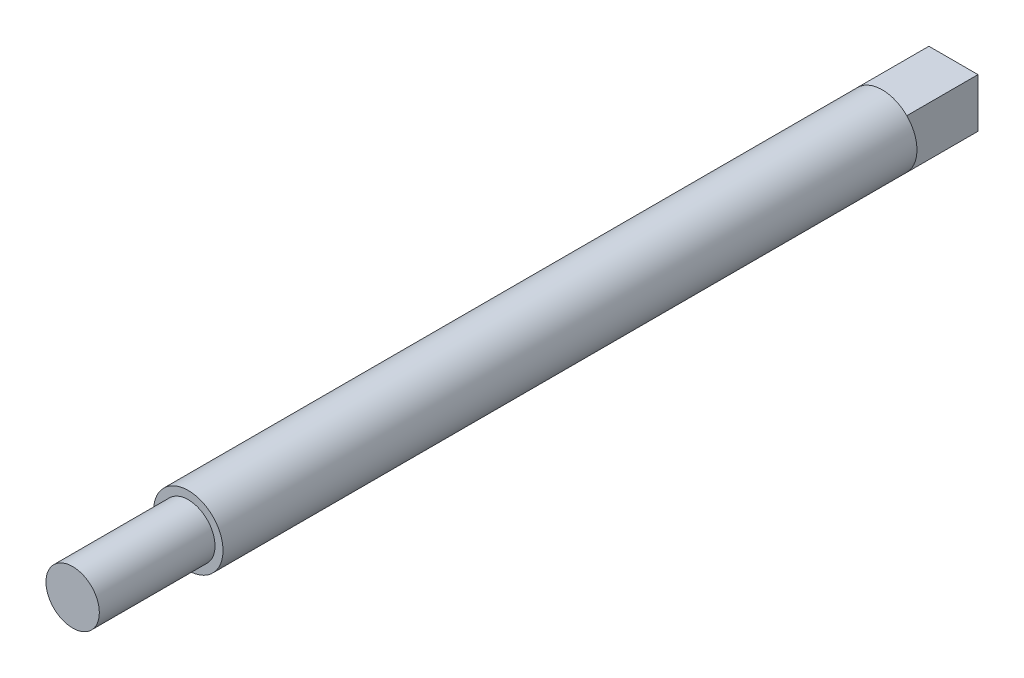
from build123d import *

# Parameters (mm, degrees)
ESQUISSE1_R             = 1.95
BOSS_EXTRU_1_DEPTH      = 45.5
ESQUISSE3_OUTSIDE_W     = 15.066
ESQUISSE3_OUTSIDE_H     = 15.066
ESQUISSE3_OUTSIDE_R     = 1.5
ENL_V_MAT_EXTRU_2_DEPTH = 6.5
ESQUISSE4_W             = 2.76
ESQUISSE4_H             = 2.76
BOSS_EXTRU_2_DEPTH      = 4


with BuildPart() as part:
    # Esquisse1 → Boss.-Extru.1 (new body)
    with BuildSketch(Plane.XY):
        Circle(ESQUISSE1_R)
    extrude(amount=BOSS_EXTRU_1_DEPTH)

    # Esquisse3 outside → Enl_v. mat.-Extru.2 (cut)
    with BuildSketch(Plane.XY.offset(45.5)):
        Rectangle(ESQUISSE3_OUTSIDE_W, ESQUISSE3_OUTSIDE_H)
        Circle(ESQUISSE3_OUTSIDE_R, mode=Mode.SUBTRACT)
    extrude(amount=-ENL_V_MAT_EXTRU_2_DEPTH, mode=Mode.SUBTRACT)

    # Esquisse4 → Boss.-Extru.2 (add)
    with BuildSketch(Plane(origin=(0, 0, 0), x_dir=(-1, 0, 0), z_dir=(0, 0, -1))):
        Rectangle(ESQUISSE4_W, ESQUISSE4_H)
    extrude(amount=BOSS_EXTRU_2_DEPTH)


solid = part.part
